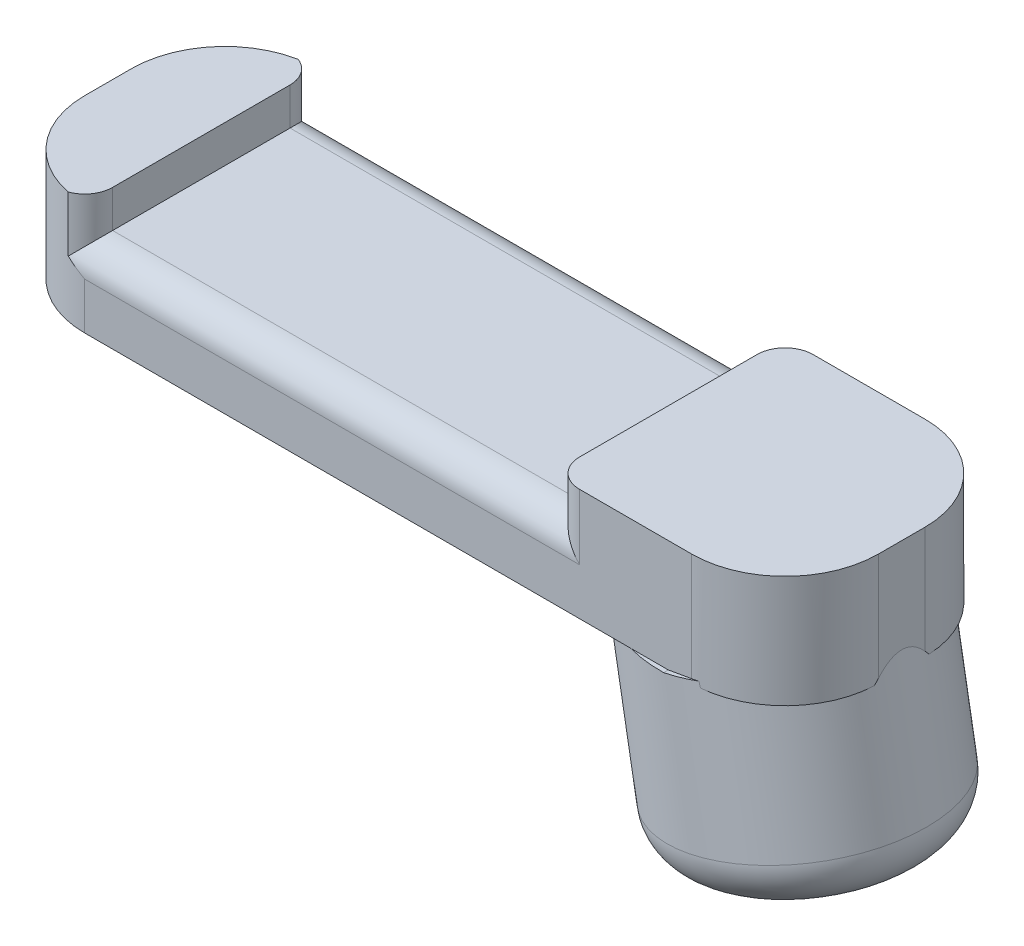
ISO-10303-21;
HEADER;
FILE_DESCRIPTION(('STEP AP214'),'2;1');
FILE_NAME('part.step','',(''),(''),'','','');
FILE_SCHEMA(('AUTOMOTIVE_DESIGN { 1 0 10303 214 1 1 1 1 }'));
ENDSEC;
DATA;
#1=APPLICATION_CONTEXT('core data for automotive mechanical design processes');
#2=APPLICATION_PROTOCOL_DEFINITION('international standard','automotive_design',2000,#1);
#3=PRODUCT_CONTEXT('',#1,'mechanical');
#4=PRODUCT('Part','Part','',(#3));
#5=PRODUCT_RELATED_PRODUCT_CATEGORY('part','',(#4));
#6=PRODUCT_DEFINITION_FORMATION('','',#4);
#7=PRODUCT_DEFINITION_CONTEXT('part definition',#1,'design');
#8=PRODUCT_DEFINITION('design','',#6,#7);
#9=PRODUCT_DEFINITION_SHAPE('','',#8);
#10=(LENGTH_UNIT() NAMED_UNIT(*) SI_UNIT(.MILLI.,.METRE.));
#11=(NAMED_UNIT(*) PLANE_ANGLE_UNIT() SI_UNIT($,.RADIAN.));
#12=(NAMED_UNIT(*) SI_UNIT($,.STERADIAN.) SOLID_ANGLE_UNIT());
#13=UNCERTAINTY_MEASURE_WITH_UNIT(LENGTH_MEASURE(1.E-05),#10,'distance_accuracy_value','');
#14=(GEOMETRIC_REPRESENTATION_CONTEXT(3) GLOBAL_UNCERTAINTY_ASSIGNED_CONTEXT((#13)) GLOBAL_UNIT_ASSIGNED_CONTEXT((#10,
#11,#12)) REPRESENTATION_CONTEXT('',''));
#15=CARTESIAN_POINT('',(0.,0.,0.));
#16=DIRECTION('',(0.,0.,1.));
#17=DIRECTION('',(1.,0.,0.));
#18=AXIS2_PLACEMENT_3D('',#15,#16,#17);
#19=CARTESIAN_POINT('',(-85.,-6.,12.5));
#20=DIRECTION('',(0.,-1.,0.));
#21=DIRECTION('',(0.,0.,-1.));
#22=AXIS2_PLACEMENT_3D('',#19,#20,#21);
#23=PLANE('',#22);
#24=CARTESIAN_POINT('',(-12.8694511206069,-6.,0.));
#25=DIRECTION('',(0.,-1.,0.));
#26=DIRECTION('',(1.,0.,0.));
#27=AXIS2_PLACEMENT_3D('',#24,#25,#26);
#28=ELLIPSE('',#27,10.6619794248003,10.5);
#29=CARTESIAN_POINT('',(-2.20747169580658,-6.,0.));
#30=VERTEX_POINT('',#29);
#31=EDGE_CURVE('E301',#30,#30,#28,.F.);
#32=ORIENTED_EDGE('',*,*,#31,.F.);
#33=EDGE_LOOP('',(#32));
#34=FACE_BOUND('',#33,.T.);
#35=CARTESIAN_POINT('',(-12.8694511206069,-6.,0.));
#36=DIRECTION('',(0.,-1.,0.));
#37=DIRECTION('',(1.,0.,0.));
#38=AXIS2_PLACEMENT_3D('',#35,#36,#37);
#39=ELLIPSE('',#38,8.12341289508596,8.);
#40=CARTESIAN_POINT('',(-4.74603822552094,-6.,0.));
#41=VERTEX_POINT('',#40);
#42=EDGE_CURVE('E77',#41,#41,#39,.F.);
#43=ORIENTED_EDGE('',*,*,#42,.T.);
#44=EDGE_LOOP('',(#43));
#45=FACE_BOUND('',#44,.T.);
#46=ADVANCED_FACE('F69',(#34,#45),#23,.T.);
#47=CARTESIAN_POINT('',(-10.,-5.99999999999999,-2.5));
#48=DIRECTION('',(0.,-1.,0.));
#49=DIRECTION('',(0.,0.,-1.));
#50=AXIS2_PLACEMENT_3D('',#47,#48,#49);
#51=CIRCLE('',#50,10.);
#52=CARTESIAN_POINT('',(-9.10343892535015,-5.99999999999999,-12.4597278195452));
#53=VERTEX_POINT('',#52);
#54=CARTESIAN_POINT('',(-0.00940525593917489,-5.99999999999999,-2.93360887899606));
#55=VERTEX_POINT('',#54);
#56=EDGE_CURVE('E341',#53,#55,#51,.T.);
#57=ORIENTED_EDGE('',*,*,#56,.T.);
#58=CARTESIAN_POINT('',(-12.8694511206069,-6.,0.));
#59=DIRECTION('',(0.,-1.,0.));
#60=DIRECTION('',(1.,0.,0.));
#61=AXIS2_PLACEMENT_3D('',#58,#59,#60);
#62=ELLIPSE('',#61,13.2005459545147,13.);
#63=EDGE_CURVE('E261',#55,#53,#62,.F.);
#64=ORIENTED_EDGE('',*,*,#63,.T.);
#65=EDGE_LOOP('',(#57,#64));
#66=FACE_BOUND('',#65,.T.);
#67=ADVANCED_FACE('F320',(#66),#23,.T.);
#68=DIRECTION('',(1.,0.,0.));
#69=VECTOR('',#68,1.);
#70=CARTESIAN_POINT('',(-85.,-5.99999999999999,-12.5));
#71=LINE('',#70,#69);
#72=CARTESIAN_POINT('',(-75.,-5.99999999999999,-12.5));
#73=VERTEX_POINT('',#72);
#74=CARTESIAN_POINT('',(-16.4952493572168,-5.99999999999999,-12.5));
#75=VERTEX_POINT('',#74);
#76=EDGE_CURVE('E384',#73,#75,#71,.T.);
#77=ORIENTED_EDGE('',*,*,#76,.T.);
#78=CARTESIAN_POINT('',(-12.8694511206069,-6.,0.));
#79=DIRECTION('',(0.,-1.,0.));
#80=DIRECTION('',(1.,0.,0.));
#81=AXIS2_PLACEMENT_3D('',#78,#79,#80);
#82=ELLIPSE('',#81,13.2005459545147,13.);
#83=CARTESIAN_POINT('',(-16.4952493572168,-6.,12.5));
#84=VERTEX_POINT('',#83);
#85=EDGE_CURVE('E237',#84,#75,#82,.T.);
#86=ORIENTED_EDGE('',*,*,#85,.F.);
#87=DIRECTION('',(1.,0.,0.));
#88=VECTOR('',#87,1.);
#89=CARTESIAN_POINT('',(-85.,-6.,12.5));
#90=LINE('',#89,#88);
#91=CARTESIAN_POINT('',(-75.,-6.,12.5));
#92=VERTEX_POINT('',#91);
#93=EDGE_CURVE('E381',#92,#84,#90,.T.);
#94=ORIENTED_EDGE('',*,*,#93,.F.);
#95=CARTESIAN_POINT('',(-75.,-5.99999999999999,2.5));
#96=DIRECTION('',(0.,-1.,0.));
#97=DIRECTION('',(0.,0.,-1.));
#98=AXIS2_PLACEMENT_3D('',#95,#96,#97);
#99=CIRCLE('',#98,10.);
#100=CARTESIAN_POINT('',(-85.,-5.99999999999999,2.5));
#101=VERTEX_POINT('',#100);
#102=EDGE_CURVE('E421',#92,#101,#99,.T.);
#103=ORIENTED_EDGE('',*,*,#102,.T.);
#104=DIRECTION('',(0.,0.,-1.));
#105=VECTOR('',#104,1.);
#106=CARTESIAN_POINT('',(-85.,-6.,12.5));
#107=LINE('',#106,#105);
#108=CARTESIAN_POINT('',(-85.,-5.99999999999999,-2.5));
#109=VERTEX_POINT('',#108);
#110=EDGE_CURVE('E392',#101,#109,#107,.T.);
#111=ORIENTED_EDGE('',*,*,#110,.T.);
#112=CARTESIAN_POINT('',(-75.,-5.99999999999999,-2.5));
#113=DIRECTION('',(0.,-1.,0.));
#114=DIRECTION('',(0.,0.,-1.));
#115=AXIS2_PLACEMENT_3D('',#112,#113,#114);
#116=CIRCLE('',#115,10.);
#117=EDGE_CURVE('E750',#109,#73,#116,.T.);
#118=ORIENTED_EDGE('',*,*,#117,.T.);
#119=EDGE_LOOP('',(#77,#86,#94,#103,#111,#118));
#120=FACE_BOUND('',#119,.T.);
#121=ADVANCED_FACE('F326',(#120),#23,.T.);
#122=CARTESIAN_POINT('',(-10.,-5.99999999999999,2.5));
#123=DIRECTION('',(0.,-1.,0.));
#124=DIRECTION('',(0.,0.,-1.));
#125=AXIS2_PLACEMENT_3D('',#122,#123,#124);
#126=CIRCLE('',#125,10.);
#127=CARTESIAN_POINT('',(-0.00940525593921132,-5.99999999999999,2.93360887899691));
#128=VERTEX_POINT('',#127);
#129=CARTESIAN_POINT('',(-9.10343892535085,-6.,12.4597278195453));
#130=VERTEX_POINT('',#129);
#131=EDGE_CURVE('E339',#128,#130,#126,.T.);
#132=ORIENTED_EDGE('',*,*,#131,.T.);
#133=EDGE_CURVE('E258',#130,#128,#62,.F.);
#134=ORIENTED_EDGE('',*,*,#133,.T.);
#135=EDGE_LOOP('',(#132,#134));
#136=FACE_BOUND('',#135,.T.);
#137=ADVANCED_FACE('F316',(#136),#23,.T.);
#138=CARTESIAN_POINT('',(-10.,0.,-2.5));
#139=DIRECTION('',(0.,1.,0.));
#140=DIRECTION('',(0.,0.,1.));
#141=AXIS2_PLACEMENT_3D('',#138,#139,#140);
#142=CYLINDRICAL_SURFACE('',#141,10.);
#143=DIRECTION('',(0.,1.,0.));
#144=VECTOR('',#143,1.);
#145=CARTESIAN_POINT('',(0.,0.,-2.5));
#146=LINE('',#145,#144);
#147=CARTESIAN_POINT('',(0.,-5.51962881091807,-2.5));
#148=VERTEX_POINT('',#147);
#149=CARTESIAN_POINT('',(0.,6.,-2.5));
#150=VERTEX_POINT('',#149);
#151=EDGE_CURVE('E356',#148,#150,#146,.T.);
#152=ORIENTED_EDGE('',*,*,#151,.F.);
#153=CARTESIAN_POINT('',(0.,-5.51962881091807,-2.5));
#154=CARTESIAN_POINT('',(1.6046536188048E-05,-5.60036819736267,-2.57155190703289));
#155=CARTESIAN_POINT('',(-0.000759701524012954,-5.68076882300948,-2.64346193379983));
#156=CARTESIAN_POINT('',(-0.00389478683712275,-5.84089255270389,-2.78799822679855));
#157=CARTESIAN_POINT('',(-0.00625412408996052,-5.92061565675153,-2.8606244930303));
#158=CARTESIAN_POINT('',(-0.00940525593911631,-6.0000000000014,-2.93360887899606));
#159=B_SPLINE_CURVE_WITH_KNOTS('',3,(#153,#154,#155,#156,#157,#158),.UNSPECIFIED.,.F.,.F.,(4,2,
4),(0.,0.323609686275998,0.647219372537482),.UNSPECIFIED.);
#160=EDGE_CURVE('E263',#148,#55,#159,.T.);
#161=ORIENTED_EDGE('',*,*,#160,.T.);
#162=ORIENTED_EDGE('',*,*,#56,.F.);
#163=CARTESIAN_POINT('',(-9.10343892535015,-5.99999999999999,-12.4597278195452));
#164=CARTESIAN_POINT('',(-9.16677162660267,-5.75096943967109,-12.4654163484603));
#165=CARTESIAN_POINT('',(-9.22758186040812,-5.50129587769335,-12.4702940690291));
#166=CARTESIAN_POINT('',(-9.34487475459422,-5.00097040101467,-12.4786938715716));
#167=CARTESIAN_POINT('',(-9.40135841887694,-4.75031872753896,-12.4822162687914));
#168=CARTESIAN_POINT('',(-9.51074322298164,-4.24823363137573,-12.4881737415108));
#169=CARTESIAN_POINT('',(-9.56364443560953,-3.996800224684,-12.4906088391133));
#170=CARTESIAN_POINT('',(-9.66639011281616,-3.49324035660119,-12.4945644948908));
#171=CARTESIAN_POINT('',(-9.71623386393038,-3.24111374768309,-12.4960848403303));
#172=CARTESIAN_POINT('',(-9.76479902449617,-2.98874592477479,-12.4972336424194));
#173=B_SPLINE_CURVE_WITH_KNOTS('',3,(#163,#164,#165,#166,#167,#168,#169,#170,#171,#172),
.UNSPECIFIED.,.F.,.F.,(4,2,2,2,4),(0.,0.771023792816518,1.54186813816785,2.31269681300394,
3.08370468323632),.UNSPECIFIED.);
#174=CARTESIAN_POINT('',(-9.24485749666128,-5.42603055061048,-12.4714472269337));
#175=VERTEX_POINT('',#174);
#176=EDGE_CURVE('E270',#53,#175,#173,.T.);
#177=ORIENTED_EDGE('',*,*,#176,.T.);
#178=CARTESIAN_POINT('',(-10.,-5.55918254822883,-2.5));
#179=DIRECTION('',(-0.173648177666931,0.984807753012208,0.));
#180=DIRECTION('',(0.984807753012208,0.173648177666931,0.));
#181=AXIS2_PLACEMENT_3D('',#178,#179,#180);
#182=ELLIPSE('',#181,10.1542661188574,10.);
#183=CARTESIAN_POINT('',(-9.99999999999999,-5.55918254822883,-12.5));
#184=VERTEX_POINT('',#183);
#185=EDGE_CURVE('E254',#184,#175,#182,.F.);
#186=ORIENTED_EDGE('',*,*,#185,.F.);
#187=DIRECTION('',(0.,1.,0.));
#188=VECTOR('',#187,1.);
#189=CARTESIAN_POINT('',(-9.99999999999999,-5.99999999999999,-12.5));
#190=LINE('',#189,#188);
#191=CARTESIAN_POINT('',(-9.99999999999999,6.,-12.5));
#192=VERTEX_POINT('',#191);
#193=EDGE_CURVE('E342',#192,#184,#190,.F.);
#194=ORIENTED_EDGE('',*,*,#193,.F.);
#195=CARTESIAN_POINT('',(-10.,6.,-2.5));
#196=DIRECTION('',(0.,1.,0.));
#197=DIRECTION('',(0.,0.,1.));
#198=AXIS2_PLACEMENT_3D('',#195,#196,#197);
#199=CIRCLE('',#198,10.);
#200=EDGE_CURVE('E367',#150,#192,#199,.T.);
#201=ORIENTED_EDGE('',*,*,#200,.F.);
#202=EDGE_LOOP('',(#152,#161,#162,#177,#186,#194,#201));
#203=FACE_BOUND('',#202,.T.);
#204=ADVANCED_FACE('F275',(#203),#142,.T.);
#205=CARTESIAN_POINT('',(-10.,0.,2.5));
#206=DIRECTION('',(0.,-1.,0.));
#207=DIRECTION('',(0.,0.,-1.));
#208=AXIS2_PLACEMENT_3D('',#205,#206,#207);
#209=CYLINDRICAL_SURFACE('',#208,10.);
#210=ORIENTED_EDGE('',*,*,#131,.F.);
#211=CARTESIAN_POINT('',(-0.00940525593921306,-6.,2.93360887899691));
#212=CARTESIAN_POINT('',(-0.00625412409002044,-5.92061565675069,2.86062449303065));
#213=CARTESIAN_POINT('',(-0.00389478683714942,-5.84089255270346,2.78799822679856));
#214=CARTESIAN_POINT('',(-0.000759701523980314,-5.68076882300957,2.6434619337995));
#215=CARTESIAN_POINT('',(1.60465362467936E-05,-5.60036819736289,2.57155190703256));
#216=CARTESIAN_POINT('',(0.,-5.51962881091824,2.49999999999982));
#217=B_SPLINE_CURVE_WITH_KNOTS('',3,(#211,#212,#213,#214,#215,#216),.UNSPECIFIED.,.F.,.F.,(4,2,
4),(0.,0.323609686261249,0.647219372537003),.UNSPECIFIED.);
#218=CARTESIAN_POINT('',(0.,-5.51962881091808,2.5));
#219=VERTEX_POINT('',#218);
#220=EDGE_CURVE('E296',#128,#219,#217,.T.);
#221=ORIENTED_EDGE('',*,*,#220,.T.);
#222=DIRECTION('',(0.,-1.,0.));
#223=VECTOR('',#222,1.);
#224=CARTESIAN_POINT('',(0.,0.,2.5));
#225=LINE('',#224,#223);
#226=CARTESIAN_POINT('',(0.,6.,2.5));
#227=VERTEX_POINT('',#226);
#228=EDGE_CURVE('E349',#227,#219,#225,.T.);
#229=ORIENTED_EDGE('',*,*,#228,.F.);
#230=CARTESIAN_POINT('',(-10.,6.,2.5));
#231=DIRECTION('',(0.,1.,0.));
#232=DIRECTION('',(0.,0.,1.));
#233=AXIS2_PLACEMENT_3D('',#230,#231,#232);
#234=CIRCLE('',#233,10.);
#235=CARTESIAN_POINT('',(-9.99999999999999,6.,12.5));
#236=VERTEX_POINT('',#235);
#237=EDGE_CURVE('E359',#236,#227,#234,.T.);
#238=ORIENTED_EDGE('',*,*,#237,.F.);
#239=DIRECTION('',(0.,-1.,0.));
#240=VECTOR('',#239,1.);
#241=CARTESIAN_POINT('',(-9.99999999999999,6.,12.5));
#242=LINE('',#241,#240);
#243=CARTESIAN_POINT('',(-9.99999999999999,-5.55918254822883,12.5));
#244=VERTEX_POINT('',#243);
#245=EDGE_CURVE('E372',#244,#236,#242,.F.);
#246=ORIENTED_EDGE('',*,*,#245,.F.);
#247=CARTESIAN_POINT('',(-10.,-5.55918254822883,2.5));
#248=DIRECTION('',(-0.173648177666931,0.984807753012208,0.));
#249=DIRECTION('',(-0.984807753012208,-0.173648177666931,0.));
#250=AXIS2_PLACEMENT_3D('',#247,#248,#249);
#251=ELLIPSE('',#250,10.1542661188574,10.);
#252=CARTESIAN_POINT('',(-9.2448574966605,-5.42603055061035,12.4714472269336));
#253=VERTEX_POINT('',#252);
#254=EDGE_CURVE('E373',#253,#244,#251,.F.);
#255=ORIENTED_EDGE('',*,*,#254,.F.);
#256=CARTESIAN_POINT('',(-9.76479902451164,-2.98874592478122,12.4972336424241));
#257=CARTESIAN_POINT('',(-9.71623386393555,-3.24111374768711,12.4960848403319));
#258=CARTESIAN_POINT('',(-9.66639011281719,-3.49324035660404,12.4945644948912));
#259=CARTESIAN_POINT('',(-9.56364443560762,-3.99680022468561,12.4906088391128));
#260=CARTESIAN_POINT('',(-9.51074322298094,-4.24823363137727,12.4881737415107));
#261=CARTESIAN_POINT('',(-9.4013584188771,-4.75031872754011,12.4822162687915));
#262=CARTESIAN_POINT('',(-9.34487475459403,-5.0009704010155,12.4786938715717));
#263=CARTESIAN_POINT('',(-9.22758186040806,-5.50129587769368,12.470294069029));
#264=CARTESIAN_POINT('',(-9.1667716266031,-5.75096943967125,12.4654163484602));
#265=CARTESIAN_POINT('',(-9.10343892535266,-6.00000000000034,12.4597278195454));
#266=B_SPLINE_CURVE_WITH_KNOTS('',3,(#256,#257,#258,#259,#260,#261,#262,#263,#264,#265),
.UNSPECIFIED.,.F.,.F.,(4,2,2,2,4),(0.,0.771007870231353,1.54183654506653,2.31268089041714,
3.08370468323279),.UNSPECIFIED.);
#267=EDGE_CURVE('E244',#253,#130,#266,.T.);
#268=ORIENTED_EDGE('',*,*,#267,.T.);
#269=EDGE_LOOP('',(#210,#221,#229,#238,#246,#255,#268));
#270=FACE_BOUND('',#269,.T.);
#271=ADVANCED_FACE('F302',(#270),#209,.T.);
#272=CARTESIAN_POINT('',(-85.,6.,-12.5));
#273=DIRECTION('',(0.,1.,0.));
#274=DIRECTION('',(0.,0.,1.));
#275=AXIS2_PLACEMENT_3D('',#272,#273,#274);
#276=PLANE('',#275);
#277=DIRECTION('',(0.,0.,1.));
#278=VECTOR('',#277,1.);
#279=CARTESIAN_POINT('',(0.,6.,-12.5));
#280=LINE('',#279,#278);
#281=EDGE_CURVE('E355',#150,#227,#280,.T.);
#282=ORIENTED_EDGE('',*,*,#281,.F.);
#283=ORIENTED_EDGE('',*,*,#200,.T.);
#284=DIRECTION('',(1.,0.,0.));
#285=VECTOR('',#284,1.);
#286=CARTESIAN_POINT('',(-85.,6.,-12.5));
#287=LINE('',#286,#285);
#288=CARTESIAN_POINT('',(-22.,6.,-12.5));
#289=VERTEX_POINT('',#288);
#290=EDGE_CURVE('E385',#289,#192,#287,.T.);
#291=ORIENTED_EDGE('',*,*,#290,.F.);
#292=CARTESIAN_POINT('',(-22.,6.,-9.5));
#293=DIRECTION('',(0.,1.,0.));
#294=DIRECTION('',(0.,0.,1.));
#295=AXIS2_PLACEMENT_3D('',#292,#293,#294);
#296=CIRCLE('',#295,3.);
#297=CARTESIAN_POINT('',(-25.,6.,-9.49999999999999));
#298=VERTEX_POINT('',#297);
#299=EDGE_CURVE('E766',#289,#298,#296,.T.);
#300=ORIENTED_EDGE('',*,*,#299,.T.);
#301=DIRECTION('',(0.,0.,-1.));
#302=VECTOR('',#301,1.);
#303=CARTESIAN_POINT('',(-25.,6.,12.5));
#304=LINE('',#303,#302);
#305=CARTESIAN_POINT('',(-25.,6.,9.5));
#306=VERTEX_POINT('',#305);
#307=EDGE_CURVE('E734',#306,#298,#304,.T.);
#308=ORIENTED_EDGE('',*,*,#307,.F.);
#309=CARTESIAN_POINT('',(-22.,6.,9.5));
#310=DIRECTION('',(0.,1.,0.));
#311=DIRECTION('',(0.,0.,1.));
#312=AXIS2_PLACEMENT_3D('',#309,#310,#311);
#313=CIRCLE('',#312,3.);
#314=CARTESIAN_POINT('',(-22.,6.,12.5));
#315=VERTEX_POINT('',#314);
#316=EDGE_CURVE('E768',#306,#315,#313,.T.);
#317=ORIENTED_EDGE('',*,*,#316,.T.);
#318=DIRECTION('',(1.,0.,0.));
#319=VECTOR('',#318,1.);
#320=CARTESIAN_POINT('',(-85.,6.,12.5));
#321=LINE('',#320,#319);
#322=EDGE_CURVE('E382',#315,#236,#321,.T.);
#323=ORIENTED_EDGE('',*,*,#322,.T.);
#324=ORIENTED_EDGE('',*,*,#237,.T.);
#325=EDGE_LOOP('',(#282,#283,#291,#300,#308,#317,#323,#324));
#326=FACE_BOUND('',#325,.T.);
#327=ADVANCED_FACE('F305',(#326),#276,.T.);
#328=CARTESIAN_POINT('',(-85.,-5.99999999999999,-12.5));
#329=DIRECTION('',(0.,0.,-1.));
#330=DIRECTION('',(-1.,0.,0.));
#331=AXIS2_PLACEMENT_3D('',#328,#329,#330);
#332=PLANE('',#331);
#333=DIRECTION('',(0.984807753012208,0.173648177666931,0.));
#334=VECTOR('',#333,1.);
#335=CARTESIAN_POINT('',(-82.8138575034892,-18.3982301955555,-12.5));
#336=LINE('',#335,#334);
#337=CARTESIAN_POINT('',(-12.5,-5.99999999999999,-12.5));
#338=VERTEX_POINT('',#337);
#339=EDGE_CURVE('E84',#338,#184,#336,.T.);
#340=ORIENTED_EDGE('',*,*,#339,.F.);
#341=DIRECTION('',(-1.,0.,0.));
#342=VECTOR('',#341,1.);
#343=CARTESIAN_POINT('',(-85.,-5.99999999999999,-12.5));
#344=LINE('',#343,#342);
#345=EDGE_CURVE('E88',#338,#75,#344,.T.);
#346=ORIENTED_EDGE('',*,*,#345,.T.);
#347=ORIENTED_EDGE('',*,*,#76,.F.);
#348=DIRECTION('',(0.,1.,0.));
#349=VECTOR('',#348,1.);
#350=CARTESIAN_POINT('',(-75.,6.,-12.5));
#351=LINE('',#350,#349);
#352=CARTESIAN_POINT('',(-75.,-1.,-12.5));
#353=VERTEX_POINT('',#352);
#354=EDGE_CURVE('E437',#73,#353,#351,.T.);
#355=ORIENTED_EDGE('',*,*,#354,.T.);
#356=DIRECTION('',(-1.,0.,0.));
#357=VECTOR('',#356,1.);
#358=CARTESIAN_POINT('',(-85.,-1.,-12.5));
#359=LINE('',#358,#357);
#360=CARTESIAN_POINT('',(-22.,-1.,-12.5));
#361=VERTEX_POINT('',#360);
#362=EDGE_CURVE('E399',#353,#361,#359,.F.);
#363=ORIENTED_EDGE('',*,*,#362,.T.);
#364=DIRECTION('',(0.,1.,0.));
#365=VECTOR('',#364,1.);
#366=CARTESIAN_POINT('',(-22.,6.,-12.5));
#367=LINE('',#366,#365);
#368=EDGE_CURVE('E773',#361,#289,#367,.T.);
#369=ORIENTED_EDGE('',*,*,#368,.T.);
#370=ORIENTED_EDGE('',*,*,#290,.T.);
#371=ORIENTED_EDGE('',*,*,#193,.T.);
#372=EDGE_LOOP('',(#340,#346,#347,#355,#363,#369,#370,#371));
#373=FACE_BOUND('',#372,.T.);
#374=ADVANCED_FACE('F312',(#373),#332,.T.);
#375=CARTESIAN_POINT('',(-85.,6.,12.5));
#376=DIRECTION('',(0.,0.,1.));
#377=DIRECTION('',(1.,0.,0.));
#378=AXIS2_PLACEMENT_3D('',#375,#376,#377);
#379=PLANE('',#378);
#380=DIRECTION('',(-0.984807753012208,-0.173648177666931,0.));
#381=VECTOR('',#380,1.);
#382=CARTESIAN_POINT('',(-80.7617366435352,-18.036385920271,12.5));
#383=LINE('',#382,#381);
#384=CARTESIAN_POINT('',(-12.5,-6.,12.5));
#385=VERTEX_POINT('',#384);
#386=EDGE_CURVE('E226',#244,#385,#383,.T.);
#387=ORIENTED_EDGE('',*,*,#386,.F.);
#388=ORIENTED_EDGE('',*,*,#245,.T.);
#389=ORIENTED_EDGE('',*,*,#322,.F.);
#390=DIRECTION('',(0.,1.,0.));
#391=VECTOR('',#390,1.);
#392=CARTESIAN_POINT('',(-22.,-1.,12.5));
#393=LINE('',#392,#391);
#394=CARTESIAN_POINT('',(-22.,-1.,12.5));
#395=VERTEX_POINT('',#394);
#396=EDGE_CURVE('E770',#315,#395,#393,.F.);
#397=ORIENTED_EDGE('',*,*,#396,.T.);
#398=DIRECTION('',(1.,0.,0.));
#399=VECTOR('',#398,1.);
#400=CARTESIAN_POINT('',(-85.,-1.,12.5));
#401=LINE('',#400,#399);
#402=CARTESIAN_POINT('',(-75.,-1.,12.5));
#403=VERTEX_POINT('',#402);
#404=EDGE_CURVE('E401',#395,#403,#401,.F.);
#405=ORIENTED_EDGE('',*,*,#404,.T.);
#406=DIRECTION('',(0.,-1.,0.));
#407=VECTOR('',#406,1.);
#408=CARTESIAN_POINT('',(-75.,-6.,12.5));
#409=LINE('',#408,#407);
#410=EDGE_CURVE('E419',#403,#92,#409,.T.);
#411=ORIENTED_EDGE('',*,*,#410,.T.);
#412=ORIENTED_EDGE('',*,*,#93,.T.);
#413=EDGE_CURVE('E234',#84,#385,#90,.T.);
#414=ORIENTED_EDGE('',*,*,#413,.T.);
#415=EDGE_LOOP('',(#387,#388,#389,#397,#405,#411,#412,#414));
#416=FACE_BOUND('',#415,.T.);
#417=ADVANCED_FACE('F377',(#416),#379,.T.);
#418=CARTESIAN_POINT('',(-78.,6.,-9.5));
#419=DIRECTION('',(0.,1.,0.));
#420=DIRECTION('',(0.,0.,1.));
#421=AXIS2_PLACEMENT_3D('',#418,#419,#420);
#422=CIRCLE('',#421,3.);
#423=CARTESIAN_POINT('',(-75.,6.,-9.5));
#424=VERTEX_POINT('',#423);
#425=CARTESIAN_POINT('',(-76.9461316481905,6.,-12.3088007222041));
#426=VERTEX_POINT('',#425);
#427=EDGE_CURVE('E414',#424,#426,#422,.T.);
#428=ORIENTED_EDGE('',*,*,#427,.T.);
#429=CARTESIAN_POINT('',(-75.,6.,-2.5));
#430=DIRECTION('',(0.,1.,0.));
#431=DIRECTION('',(0.,0.,1.));
#432=AXIS2_PLACEMENT_3D('',#429,#430,#431);
#433=CIRCLE('',#432,10.);
#434=CARTESIAN_POINT('',(-85.,6.,-2.5));
#435=VERTEX_POINT('',#434);
#436=EDGE_CURVE('E761',#426,#435,#433,.T.);
#437=ORIENTED_EDGE('',*,*,#436,.T.);
#438=DIRECTION('',(0.,0.,1.));
#439=VECTOR('',#438,1.);
#440=CARTESIAN_POINT('',(-85.,6.,-12.5));
#441=LINE('',#440,#439);
#442=CARTESIAN_POINT('',(-85.,6.,2.5));
#443=VERTEX_POINT('',#442);
#444=EDGE_CURVE('E745',#435,#443,#441,.T.);
#445=ORIENTED_EDGE('',*,*,#444,.T.);
#446=CARTESIAN_POINT('',(-75.,6.,2.5));
#447=DIRECTION('',(0.,1.,0.));
#448=DIRECTION('',(0.,0.,1.));
#449=AXIS2_PLACEMENT_3D('',#446,#447,#448);
#450=CIRCLE('',#449,10.);
#451=CARTESIAN_POINT('',(-76.9461316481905,6.,12.3088007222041));
#452=VERTEX_POINT('',#451);
#453=EDGE_CURVE('E426',#443,#452,#450,.T.);
#454=ORIENTED_EDGE('',*,*,#453,.T.);
#455=CARTESIAN_POINT('',(-78.,6.,9.5));
#456=DIRECTION('',(0.,1.,0.));
#457=DIRECTION('',(0.,0.,1.));
#458=AXIS2_PLACEMENT_3D('',#455,#456,#457);
#459=CIRCLE('',#458,3.);
#460=CARTESIAN_POINT('',(-75.,6.,9.49999999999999));
#461=VERTEX_POINT('',#460);
#462=EDGE_CURVE('E404',#452,#461,#459,.T.);
#463=ORIENTED_EDGE('',*,*,#462,.T.);
#464=DIRECTION('',(0.,0.,1.));
#465=VECTOR('',#464,1.);
#466=CARTESIAN_POINT('',(-75.,6.,-12.5));
#467=LINE('',#466,#465);
#468=EDGE_CURVE('E732',#424,#461,#467,.T.);
#469=ORIENTED_EDGE('',*,*,#468,.F.);
#470=EDGE_LOOP('',(#428,#437,#445,#454,#463,#469));
#471=FACE_BOUND('',#470,.T.);
#472=ADVANCED_FACE('F315',(#471),#276,.T.);
#473=CARTESIAN_POINT('',(-85.,0.,0.));
#474=DIRECTION('',(1.,0.,0.));
#475=DIRECTION('',(0.,0.,-1.));
#476=AXIS2_PLACEMENT_3D('',#473,#474,#475);
#477=PLANE('',#476);
#478=ORIENTED_EDGE('',*,*,#444,.F.);
#479=DIRECTION('',(0.,1.,0.));
#480=VECTOR('',#479,1.);
#481=CARTESIAN_POINT('',(-85.,-5.99999999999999,-2.5));
#482=LINE('',#481,#480);
#483=EDGE_CURVE('E755',#435,#109,#482,.F.);
#484=ORIENTED_EDGE('',*,*,#483,.T.);
#485=ORIENTED_EDGE('',*,*,#110,.F.);
#486=DIRECTION('',(0.,-1.,0.));
#487=VECTOR('',#486,1.);
#488=CARTESIAN_POINT('',(-85.,6.,2.5));
#489=LINE('',#488,#487);
#490=EDGE_CURVE('E423',#101,#443,#489,.F.);
#491=ORIENTED_EDGE('',*,*,#490,.T.);
#492=EDGE_LOOP('',(#478,#484,#485,#491));
#493=FACE_BOUND('',#492,.T.);
#494=ADVANCED_FACE('F470',(#493),#477,.F.);
#495=CARTESIAN_POINT('',(0.,0.,0.));
#496=DIRECTION('',(1.,0.,0.));
#497=DIRECTION('',(0.,0.,-1.));
#498=AXIS2_PLACEMENT_3D('',#495,#496,#497);
#499=PLANE('',#498);
#500=ORIENTED_EDGE('',*,*,#228,.T.);
#501=CARTESIAN_POINT('',(0.,-78.9862841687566,0.));
#502=DIRECTION('',(1.,0.,0.));
#503=DIRECTION('',(0.,-1.,0.));
#504=AXIS2_PLACEMENT_3D('',#501,#502,#503);
#505=ELLIPSE('',#504,74.8640162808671,13.);
#506=EDGE_CURVE('E260',#219,#148,#505,.F.);
#507=ORIENTED_EDGE('',*,*,#506,.T.);
#508=ORIENTED_EDGE('',*,*,#151,.T.);
#509=ORIENTED_EDGE('',*,*,#281,.T.);
#510=EDGE_LOOP('',(#500,#507,#508,#509));
#511=FACE_BOUND('',#510,.T.);
#512=ADVANCED_FACE('F352',(#511),#499,.T.);
#513=CARTESIAN_POINT('',(-25.,2.,12.5));
#514=DIRECTION('',(1.,0.,0.));
#515=DIRECTION('',(0.,0.,-1.));
#516=AXIS2_PLACEMENT_3D('',#513,#514,#515);
#517=PLANE('',#516);
#518=DIRECTION('',(0.,0.,-1.));
#519=VECTOR('',#518,1.);
#520=CARTESIAN_POINT('',(-25.,2.,12.5));
#521=LINE('',#520,#519);
#522=CARTESIAN_POINT('',(-25.,2.,9.5));
#523=VERTEX_POINT('',#522);
#524=CARTESIAN_POINT('',(-25.,2.,-9.49999999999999));
#525=VERTEX_POINT('',#524);
#526=EDGE_CURVE('E740',#523,#525,#521,.T.);
#527=ORIENTED_EDGE('',*,*,#526,.F.);
#528=DIRECTION('',(0.,1.,0.));
#529=VECTOR('',#528,1.);
#530=CARTESIAN_POINT('',(-25.,6.,9.5));
#531=LINE('',#530,#529);
#532=EDGE_CURVE('E759',#523,#306,#531,.T.);
#533=ORIENTED_EDGE('',*,*,#532,.T.);
#534=ORIENTED_EDGE('',*,*,#307,.T.);
#535=DIRECTION('',(0.,1.,0.));
#536=VECTOR('',#535,1.);
#537=CARTESIAN_POINT('',(-25.,-1.,-9.5));
#538=LINE('',#537,#536);
#539=EDGE_CURVE('E757',#298,#525,#538,.F.);
#540=ORIENTED_EDGE('',*,*,#539,.T.);
#541=EDGE_LOOP('',(#527,#533,#534,#540));
#542=FACE_BOUND('',#541,.T.);
#543=ADVANCED_FACE('F496',(#542),#517,.F.);
#544=CARTESIAN_POINT('',(-75.,2.,-12.5));
#545=DIRECTION('',(-1.,0.,0.));
#546=DIRECTION('',(0.,0.,1.));
#547=AXIS2_PLACEMENT_3D('',#544,#545,#546);
#548=PLANE('',#547);
#549=DIRECTION('',(0.,0.,1.));
#550=VECTOR('',#549,1.);
#551=CARTESIAN_POINT('',(-75.,2.,-12.5));
#552=LINE('',#551,#550);
#553=CARTESIAN_POINT('',(-75.,2.,-9.5));
#554=VERTEX_POINT('',#553);
#555=CARTESIAN_POINT('',(-75.,2.,9.49999999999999));
#556=VERTEX_POINT('',#555);
#557=EDGE_CURVE('E737',#554,#556,#552,.T.);
#558=ORIENTED_EDGE('',*,*,#557,.F.);
#559=DIRECTION('',(0.,1.,0.));
#560=VECTOR('',#559,1.);
#561=CARTESIAN_POINT('',(-75.,6.,-9.5));
#562=LINE('',#561,#560);
#563=EDGE_CURVE('E411',#554,#424,#562,.T.);
#564=ORIENTED_EDGE('',*,*,#563,.T.);
#565=ORIENTED_EDGE('',*,*,#468,.T.);
#566=DIRECTION('',(0.,1.,0.));
#567=VECTOR('',#566,1.);
#568=CARTESIAN_POINT('',(-75.,-1.,9.5));
#569=LINE('',#568,#567);
#570=EDGE_CURVE('E406',#461,#556,#569,.F.);
#571=ORIENTED_EDGE('',*,*,#570,.T.);
#572=EDGE_LOOP('',(#558,#564,#565,#571));
#573=FACE_BOUND('',#572,.T.);
#574=ADVANCED_FACE('F503',(#573),#548,.F.);
#575=CARTESIAN_POINT('',(0.,2.,0.));
#576=DIRECTION('',(0.,1.,0.));
#577=DIRECTION('',(0.,0.,1.));
#578=AXIS2_PLACEMENT_3D('',#575,#576,#577);
#579=PLANE('',#578);
#580=ORIENTED_EDGE('',*,*,#526,.T.);
#581=DIRECTION('',(-1.,0.,0.));
#582=VECTOR('',#581,1.);
#583=CARTESIAN_POINT('',(0.,2.,-9.5));
#584=LINE('',#583,#582);
#585=EDGE_CURVE('E396',#525,#554,#584,.T.);
#586=ORIENTED_EDGE('',*,*,#585,.T.);
#587=ORIENTED_EDGE('',*,*,#557,.T.);
#588=DIRECTION('',(1.,0.,0.));
#589=VECTOR('',#588,1.);
#590=CARTESIAN_POINT('',(0.,2.,9.5));
#591=LINE('',#590,#589);
#592=EDGE_CURVE('E393',#556,#523,#591,.T.);
#593=ORIENTED_EDGE('',*,*,#592,.T.);
#594=EDGE_LOOP('',(#580,#586,#587,#593));
#595=FACE_BOUND('',#594,.T.);
#596=ADVANCED_FACE('F285',(#595),#579,.T.);
#597=CARTESIAN_POINT('',(0.,-1.,-9.5));
#598=DIRECTION('',(-1.,0.,0.));
#599=DIRECTION('',(0.,0.,1.));
#600=AXIS2_PLACEMENT_3D('',#597,#598,#599);
#601=CYLINDRICAL_SURFACE('',#600,3.);
#602=ORIENTED_EDGE('',*,*,#362,.F.);
#603=CARTESIAN_POINT('',(-76.9461316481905,0.0538683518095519,-12.3088007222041));
#604=CARTESIAN_POINT('',(-76.7858835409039,-0.0308755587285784,-12.34058694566));
#605=CARTESIAN_POINT('',(-76.6253754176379,-0.116527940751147,-12.3683591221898));
#606=CARTESIAN_POINT('',(-76.3038963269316,-0.289223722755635,-12.4159621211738));
#607=CARTESIAN_POINT('',(-76.1429252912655,-0.376267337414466,-12.4357917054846));
#608=CARTESIAN_POINT('',(-75.6607677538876,-0.638105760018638,-12.4833565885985));
#609=CARTESIAN_POINT('',(-75.3390534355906,-0.814293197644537,-12.4994207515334));
#610=CARTESIAN_POINT('',(-75.0116940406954,-0.993594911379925,-12.4999948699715));
#611=CARTESIAN_POINT('',(-75.0058469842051,-0.996797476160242,-12.499999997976));
#612=CARTESIAN_POINT('',(-75.,-1.,-12.5));
#613=B_SPLINE_CURVE_WITH_KNOTS('',3,(#603,#604,#605,#606,#607,#608,#609,#610,#611,#612),
.UNSPECIFIED.,.F.,.F.,(4,2,2,2,4),(0.,0.551986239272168,1.10405849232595,2.20378685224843,
2.22378685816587),.UNSPECIFIED.);
#614=CARTESIAN_POINT('',(-76.9461316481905,0.0538683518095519,-12.3088007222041));
#615=VERTEX_POINT('',#614);
#616=EDGE_CURVE('E456',#353,#615,#613,.F.);
#617=ORIENTED_EDGE('',*,*,#616,.T.);
#618=CARTESIAN_POINT('',(-78.,-1.,-9.5));
#619=DIRECTION('',(0.707106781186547,-0.707106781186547,0.));
#620=DIRECTION('',(-0.707106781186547,-0.707106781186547,0.));
#621=AXIS2_PLACEMENT_3D('',#618,#619,#620);
#622=ELLIPSE('',#621,4.24264068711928,3.);
#623=EDGE_CURVE('E417',#615,#554,#622,.T.);
#624=ORIENTED_EDGE('',*,*,#623,.T.);
#625=ORIENTED_EDGE('',*,*,#585,.F.);
#626=CARTESIAN_POINT('',(-22.,-1.,-9.5));
#627=DIRECTION('',(-0.707106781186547,-0.707106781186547,0.));
#628=DIRECTION('',(0.707106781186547,-0.707106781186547,0.));
#629=AXIS2_PLACEMENT_3D('',#626,#627,#628);
#630=ELLIPSE('',#629,4.24264068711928,3.);
#631=EDGE_CURVE('E357',#525,#361,#630,.T.);
#632=ORIENTED_EDGE('',*,*,#631,.T.);
#633=EDGE_LOOP('',(#602,#617,#624,#625,#632));
#634=FACE_BOUND('',#633,.T.);
#635=ADVANCED_FACE('F463',(#634),#601,.T.);
#636=CARTESIAN_POINT('',(0.,-1.,9.5));
#637=DIRECTION('',(1.,0.,0.));
#638=DIRECTION('',(0.,0.,-1.));
#639=AXIS2_PLACEMENT_3D('',#636,#637,#638);
#640=CYLINDRICAL_SURFACE('',#639,3.);
#641=CARTESIAN_POINT('',(-78.,-1.,9.5));
#642=DIRECTION('',(0.707106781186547,-0.707106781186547,0.));
#643=DIRECTION('',(-0.707106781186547,-0.707106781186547,0.));
#644=AXIS2_PLACEMENT_3D('',#641,#642,#643);
#645=ELLIPSE('',#644,4.24264068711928,3.);
#646=CARTESIAN_POINT('',(-76.9461316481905,0.0538683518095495,12.3088007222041));
#647=VERTEX_POINT('',#646);
#648=EDGE_CURVE('E408',#556,#647,#645,.T.);
#649=ORIENTED_EDGE('',*,*,#648,.T.);
#650=CARTESIAN_POINT('',(-76.9461316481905,0.0538683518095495,12.3088007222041));
#651=CARTESIAN_POINT('',(-76.7858835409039,-0.0308755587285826,12.34058694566));
#652=CARTESIAN_POINT('',(-76.6253754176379,-0.116527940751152,12.3683591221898));
#653=CARTESIAN_POINT('',(-76.3038963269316,-0.289223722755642,12.4159621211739));
#654=CARTESIAN_POINT('',(-76.1429252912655,-0.376267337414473,12.4357917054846));
#655=CARTESIAN_POINT('',(-75.6607677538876,-0.638105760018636,12.4833565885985));
#656=CARTESIAN_POINT('',(-75.3390534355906,-0.814293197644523,12.4994207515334));
#657=CARTESIAN_POINT('',(-75.0116940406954,-0.993594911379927,12.4999948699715));
#658=CARTESIAN_POINT('',(-75.0058469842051,-0.996797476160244,12.499999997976));
#659=CARTESIAN_POINT('',(-75.,-1.,12.5));
#660=B_SPLINE_CURVE_WITH_KNOTS('',3,(#650,#651,#652,#653,#654,#655,#656,#657,#658,#659),
.UNSPECIFIED.,.F.,.F.,(4,2,2,2,4),(0.,0.551986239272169,1.10405849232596,2.20378685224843,
2.22378685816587),.UNSPECIFIED.);
#661=EDGE_CURVE('E430',#647,#403,#660,.T.);
#662=ORIENTED_EDGE('',*,*,#661,.T.);
#663=ORIENTED_EDGE('',*,*,#404,.F.);
#664=CARTESIAN_POINT('',(-22.,-1.,9.5));
#665=DIRECTION('',(-0.707106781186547,-0.707106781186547,0.));
#666=DIRECTION('',(0.707106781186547,-0.707106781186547,0.));
#667=AXIS2_PLACEMENT_3D('',#664,#665,#666);
#668=ELLIPSE('',#667,4.24264068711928,3.);
#669=EDGE_CURVE('E362',#395,#523,#668,.T.);
#670=ORIENTED_EDGE('',*,*,#669,.T.);
#671=ORIENTED_EDGE('',*,*,#592,.F.);
#672=EDGE_LOOP('',(#649,#662,#663,#670,#671));
#673=FACE_BOUND('',#672,.T.);
#674=ADVANCED_FACE('F439',(#673),#640,.T.);
#675=CARTESIAN_POINT('',(-78.,6.,9.5));
#676=DIRECTION('',(0.,-1.,0.));
#677=DIRECTION('',(0.,0.,-1.));
#678=AXIS2_PLACEMENT_3D('',#675,#676,#677);
#679=CYLINDRICAL_SURFACE('',#678,3.);
#680=ORIENTED_EDGE('',*,*,#462,.F.);
#681=DIRECTION('',(0.,1.,0.));
#682=VECTOR('',#681,1.);
#683=CARTESIAN_POINT('',(-76.9461316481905,6.,12.3088007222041));
#684=LINE('',#683,#682);
#685=EDGE_CURVE('E428',#452,#647,#684,.F.);
#686=ORIENTED_EDGE('',*,*,#685,.T.);
#687=ORIENTED_EDGE('',*,*,#648,.F.);
#688=ORIENTED_EDGE('',*,*,#570,.F.);
#689=EDGE_LOOP('',(#680,#686,#687,#688));
#690=FACE_BOUND('',#689,.T.);
#691=ADVANCED_FACE('F529',(#690),#679,.T.);
#692=CARTESIAN_POINT('',(-78.,2.,-9.5));
#693=DIRECTION('',(0.,-1.,0.));
#694=DIRECTION('',(0.,0.,-1.));
#695=AXIS2_PLACEMENT_3D('',#692,#693,#694);
#696=CYLINDRICAL_SURFACE('',#695,3.);
#697=ORIENTED_EDGE('',*,*,#623,.F.);
#698=DIRECTION('',(0.,-1.,0.));
#699=VECTOR('',#698,1.);
#700=CARTESIAN_POINT('',(-76.9461316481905,0.0538683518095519,-12.3088007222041));
#701=LINE('',#700,#699);
#702=EDGE_CURVE('E461',#615,#426,#701,.F.);
#703=ORIENTED_EDGE('',*,*,#702,.T.);
#704=ORIENTED_EDGE('',*,*,#427,.F.);
#705=ORIENTED_EDGE('',*,*,#563,.F.);
#706=EDGE_LOOP('',(#697,#703,#704,#705));
#707=FACE_BOUND('',#706,.T.);
#708=ADVANCED_FACE('F449',(#707),#696,.T.);
#709=CARTESIAN_POINT('',(-75.,6.,2.5));
#710=DIRECTION('',(0.,1.,0.));
#711=DIRECTION('',(0.,0.,1.));
#712=AXIS2_PLACEMENT_3D('',#709,#710,#711);
#713=CYLINDRICAL_SURFACE('',#712,10.);
#714=ORIENTED_EDGE('',*,*,#453,.F.);
#715=ORIENTED_EDGE('',*,*,#490,.F.);
#716=ORIENTED_EDGE('',*,*,#102,.F.);
#717=ORIENTED_EDGE('',*,*,#410,.F.);
#718=ORIENTED_EDGE('',*,*,#661,.F.);
#719=ORIENTED_EDGE('',*,*,#685,.F.);
#720=EDGE_LOOP('',(#714,#715,#716,#717,#718,#719));
#721=FACE_BOUND('',#720,.T.);
#722=ADVANCED_FACE('F443',(#721),#713,.T.);
#723=CARTESIAN_POINT('',(-75.,-5.99999999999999,-2.5));
#724=DIRECTION('',(0.,-1.,0.));
#725=DIRECTION('',(0.,0.,-1.));
#726=AXIS2_PLACEMENT_3D('',#723,#724,#725);
#727=CYLINDRICAL_SURFACE('',#726,10.);
#728=ORIENTED_EDGE('',*,*,#117,.F.);
#729=ORIENTED_EDGE('',*,*,#483,.F.);
#730=ORIENTED_EDGE('',*,*,#436,.F.);
#731=ORIENTED_EDGE('',*,*,#702,.F.);
#732=ORIENTED_EDGE('',*,*,#616,.F.);
#733=ORIENTED_EDGE('',*,*,#354,.F.);
#734=EDGE_LOOP('',(#728,#729,#730,#731,#732,#733));
#735=FACE_BOUND('',#734,.T.);
#736=ADVANCED_FACE('F448',(#735),#727,.T.);
#737=CARTESIAN_POINT('',(-22.,2.,9.5));
#738=DIRECTION('',(0.,-1.,0.));
#739=DIRECTION('',(0.,0.,-1.));
#740=AXIS2_PLACEMENT_3D('',#737,#738,#739);
#741=CYLINDRICAL_SURFACE('',#740,3.);
#742=ORIENTED_EDGE('',*,*,#669,.F.);
#743=ORIENTED_EDGE('',*,*,#396,.F.);
#744=ORIENTED_EDGE('',*,*,#316,.F.);
#745=ORIENTED_EDGE('',*,*,#532,.F.);
#746=EDGE_LOOP('',(#742,#743,#744,#745));
#747=FACE_BOUND('',#746,.T.);
#748=ADVANCED_FACE('F454',(#747),#741,.T.);
#749=CARTESIAN_POINT('',(-22.,-5.99999999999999,-9.5));
#750=DIRECTION('',(0.,-1.,0.));
#751=DIRECTION('',(0.,0.,-1.));
#752=AXIS2_PLACEMENT_3D('',#749,#750,#751);
#753=CYLINDRICAL_SURFACE('',#752,3.);
#754=ORIENTED_EDGE('',*,*,#631,.F.);
#755=ORIENTED_EDGE('',*,*,#539,.F.);
#756=ORIENTED_EDGE('',*,*,#299,.F.);
#757=ORIENTED_EDGE('',*,*,#368,.F.);
#758=EDGE_LOOP('',(#754,#755,#756,#757));
#759=FACE_BOUND('',#758,.T.);
#760=ADVANCED_FACE('F552',(#759),#753,.T.);
#761=CARTESIAN_POINT('',(-85.,-6.,12.5));
#762=DIRECTION('',(0.,-1.,0.));
#763=DIRECTION('',(0.,0.,-1.));
#764=AXIS2_PLACEMENT_3D('',#761,#762,#763);
#765=PLANE('',#764);
#766=ORIENTED_EDGE('',*,*,#345,.F.);
#767=DIRECTION('',(0.,0.,1.));
#768=VECTOR('',#767,1.);
#769=CARTESIAN_POINT('',(-12.5,-5.99999999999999,0.));
#770=LINE('',#769,#768);
#771=CARTESIAN_POINT('',(-12.5,-5.99999999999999,-12.9949075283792));
#772=VERTEX_POINT('',#771);
#773=EDGE_CURVE('E229',#772,#338,#770,.T.);
#774=ORIENTED_EDGE('',*,*,#773,.F.);
#775=EDGE_CURVE('E239',#75,#772,#82,.T.);
#776=ORIENTED_EDGE('',*,*,#775,.F.);
#777=EDGE_LOOP('',(#766,#774,#776));
#778=FACE_BOUND('',#777,.T.);
#779=ADVANCED_FACE('F559',(#778),#765,.F.);
#780=CARTESIAN_POINT('',(-12.8583108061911,-6.0631798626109,0.));
#781=DIRECTION('',(-0.173648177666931,0.984807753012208,0.));
#782=DIRECTION('',(-0.984807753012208,-0.173648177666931,0.));
#783=AXIS2_PLACEMENT_3D('',#780,#781,#782);
#784=PLANE('',#783);
#785=ORIENTED_EDGE('',*,*,#773,.T.);
#786=ORIENTED_EDGE('',*,*,#339,.T.);
#787=ORIENTED_EDGE('',*,*,#185,.T.);
#788=CARTESIAN_POINT('',(-12.8583108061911,-6.0631798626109,0.));
#789=DIRECTION('',(-0.173648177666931,0.984807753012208,0.));
#790=DIRECTION('',(-0.984807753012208,-0.173648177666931,0.));
#791=AXIS2_PLACEMENT_3D('',#788,#789,#790);
#792=CIRCLE('',#791,13.);
#793=EDGE_CURVE('E245',#175,#772,#792,.T.);
#794=ORIENTED_EDGE('',*,*,#793,.T.);
#795=EDGE_LOOP('',(#785,#786,#787,#794));
#796=FACE_BOUND('',#795,.T.);
#797=ADVANCED_FACE('F566',(#796),#784,.T.);
#798=CARTESIAN_POINT('',(-19.3036661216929,30.4902465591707,0.));
#799=DIRECTION('',(0.173648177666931,-0.984807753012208,0.));
#800=DIRECTION('',(0.984807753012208,0.173648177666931,0.));
#801=AXIS2_PLACEMENT_3D('',#798,#799,#800);
#802=CYLINDRICAL_SURFACE('',#801,10.5);
#803=ORIENTED_EDGE('',*,*,#31,.T.);
#804=EDGE_LOOP('',(#803));
#805=FACE_BOUND('',#804,.T.);
#806=CARTESIAN_POINT('',(-9.38534725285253,-25.7593349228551,0.));
#807=DIRECTION('',(-0.173648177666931,0.984807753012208,0.));
#808=DIRECTION('',(-0.984807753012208,-0.173648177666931,0.));
#809=AXIS2_PLACEMENT_3D('',#806,#807,#808);
#810=CIRCLE('',#809,10.5);
#811=CARTESIAN_POINT('',(-19.7258286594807,-27.5826407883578,0.));
#812=VERTEX_POINT('',#811);
#813=EDGE_CURVE('E248',#812,#812,#810,.T.);
#814=ORIENTED_EDGE('',*,*,#813,.F.);
#815=EDGE_LOOP('',(#814));
#816=FACE_BOUND('',#815,.T.);
#817=ADVANCED_FACE('F282',(#805,#816),#802,.F.);
#818=CARTESIAN_POINT('',(-19.3036661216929,30.4902465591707,0.));
#819=DIRECTION('',(0.173648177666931,-0.984807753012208,0.));
#820=DIRECTION('',(0.984807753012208,0.173648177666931,0.));
#821=AXIS2_PLACEMENT_3D('',#818,#819,#820);
#822=CYLINDRICAL_SURFACE('',#821,13.);
#823=CARTESIAN_POINT('',(-10.1372659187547,-21.4949922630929,0.));
#824=DIRECTION('',(0.173648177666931,-0.984807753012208,0.));
#825=DIRECTION('',(0.984807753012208,0.173648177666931,0.));
#826=AXIS2_PLACEMENT_3D('',#823,#824,#825);
#827=CIRCLE('',#826,13.);
#828=CARTESIAN_POINT('',(2.66523487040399,-19.2375659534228,0.));
#829=VERTEX_POINT('',#828);
#830=EDGE_CURVE('E12',#829,#829,#827,.F.);
#831=ORIENTED_EDGE('',*,*,#830,.T.);
#832=EDGE_LOOP('',(#831));
#833=FACE_BOUND('',#832,.T.);
#834=ORIENTED_EDGE('',*,*,#176,.F.);
#835=ORIENTED_EDGE('',*,*,#63,.F.);
#836=ORIENTED_EDGE('',*,*,#160,.F.);
#837=ORIENTED_EDGE('',*,*,#506,.F.);
#838=ORIENTED_EDGE('',*,*,#220,.F.);
#839=ORIENTED_EDGE('',*,*,#133,.F.);
#840=ORIENTED_EDGE('',*,*,#267,.F.);
#841=CARTESIAN_POINT('',(-12.5,-6.,12.9949075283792));
#842=VERTEX_POINT('',#841);
#843=EDGE_CURVE('E224',#842,#253,#792,.T.);
#844=ORIENTED_EDGE('',*,*,#843,.F.);
#845=EDGE_CURVE('E230',#842,#84,#82,.T.);
#846=ORIENTED_EDGE('',*,*,#845,.T.);
#847=ORIENTED_EDGE('',*,*,#85,.T.);
#848=ORIENTED_EDGE('',*,*,#775,.T.);
#849=ORIENTED_EDGE('',*,*,#793,.F.);
#850=EDGE_LOOP('',(#834,#835,#836,#837,#838,#839,#840,#844,#846,#847,#848,#849));
#851=FACE_BOUND('',#850,.T.);
#852=ADVANCED_FACE('F242',(#833,#851),#822,.T.);
#853=ORIENTED_EDGE('',*,*,#413,.F.);
#854=ORIENTED_EDGE('',*,*,#845,.F.);
#855=EDGE_CURVE('E219',#385,#842,#770,.T.);
#856=ORIENTED_EDGE('',*,*,#855,.F.);
#857=EDGE_LOOP('',(#853,#854,#856));
#858=FACE_BOUND('',#857,.T.);
#859=ADVANCED_FACE('F233',(#858),#765,.F.);
#860=ORIENTED_EDGE('',*,*,#254,.T.);
#861=ORIENTED_EDGE('',*,*,#386,.T.);
#862=ORIENTED_EDGE('',*,*,#855,.T.);
#863=ORIENTED_EDGE('',*,*,#843,.T.);
#864=EDGE_LOOP('',(#860,#861,#862,#863));
#865=FACE_BOUND('',#864,.T.);
#866=ADVANCED_FACE('F222',(#865),#784,.T.);
#867=CARTESIAN_POINT('',(-19.3036661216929,30.4902465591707,0.));
#868=DIRECTION('',(0.173648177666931,-0.984807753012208,0.));
#869=DIRECTION('',(0.984807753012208,0.173648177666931,0.));
#870=AXIS2_PLACEMENT_3D('',#867,#868,#869);
#871=CYLINDRICAL_SURFACE('',#870,8.);
#872=ORIENTED_EDGE('',*,*,#42,.F.);
#873=EDGE_LOOP('',(#872));
#874=FACE_BOUND('',#873,.T.);
#875=CARTESIAN_POINT('',(-9.38534725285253,-25.7593349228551,0.));
#876=DIRECTION('',(-0.173648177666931,0.984807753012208,0.));
#877=DIRECTION('',(-0.984807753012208,-0.173648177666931,0.));
#878=AXIS2_PLACEMENT_3D('',#875,#876,#877);
#879=CIRCLE('',#878,8.);
#880=CARTESIAN_POINT('',(-17.2638092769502,-27.1485203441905,0.));
#881=VERTEX_POINT('',#880);
#882=EDGE_CURVE('E722',#881,#881,#879,.T.);
#883=ORIENTED_EDGE('',*,*,#882,.T.);
#884=EDGE_LOOP('',(#883));
#885=FACE_BOUND('',#884,.T.);
#886=ADVANCED_FACE('F597',(#874,#885),#871,.T.);
#887=CARTESIAN_POINT('',(-9.38534725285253,-25.7593349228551,0.));
#888=DIRECTION('',(-0.173648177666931,0.984807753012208,0.));
#889=DIRECTION('',(-0.984807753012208,-0.173648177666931,0.));
#890=AXIS2_PLACEMENT_3D('',#887,#888,#889);
#891=PLANE('',#890);
#892=ORIENTED_EDGE('',*,*,#882,.F.);
#893=EDGE_LOOP('',(#892));
#894=FACE_BOUND('',#893,.T.);
#895=ADVANCED_FACE('F603',(#894),#891,.F.);
#896=CARTESIAN_POINT('',(-10.1372659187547,-21.4949922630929,0.));
#897=DIRECTION('',(0.173648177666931,-0.984807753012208,0.));
#898=DIRECTION('',(0.984807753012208,0.173648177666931,0.));
#899=AXIS2_PLACEMENT_3D('',#896,#897,#898);
#900=TOROIDAL_SURFACE('',#899,8.,5.);
#901=ORIENTED_EDGE('',*,*,#813,.T.);
#902=EDGE_LOOP('',(#901));
#903=FACE_BOUND('',#902,.T.);
#904=ORIENTED_EDGE('',*,*,#830,.F.);
#905=EDGE_LOOP('',(#904));
#906=FACE_BOUND('',#905,.T.);
#907=ADVANCED_FACE('F71',(#903,#906),#900,.T.);
#908=CLOSED_SHELL('',(#46,#67,#121,#137,#204,#271,#327,#374,#417,#472,#494,#512,#543,#574,#596,
#635,#674,#691,#708,#722,#736,#748,#760,#779,#797,#817,#852,#859,#866,#886,#895,#907));
#909=MANIFOLD_SOLID_BREP('B2',#908);
#910=ADVANCED_BREP_SHAPE_REPRESENTATION('',(#18,#909),#14);
#911=SHAPE_DEFINITION_REPRESENTATION(#9,#910);
ENDSEC;
END-ISO-10303-21;
